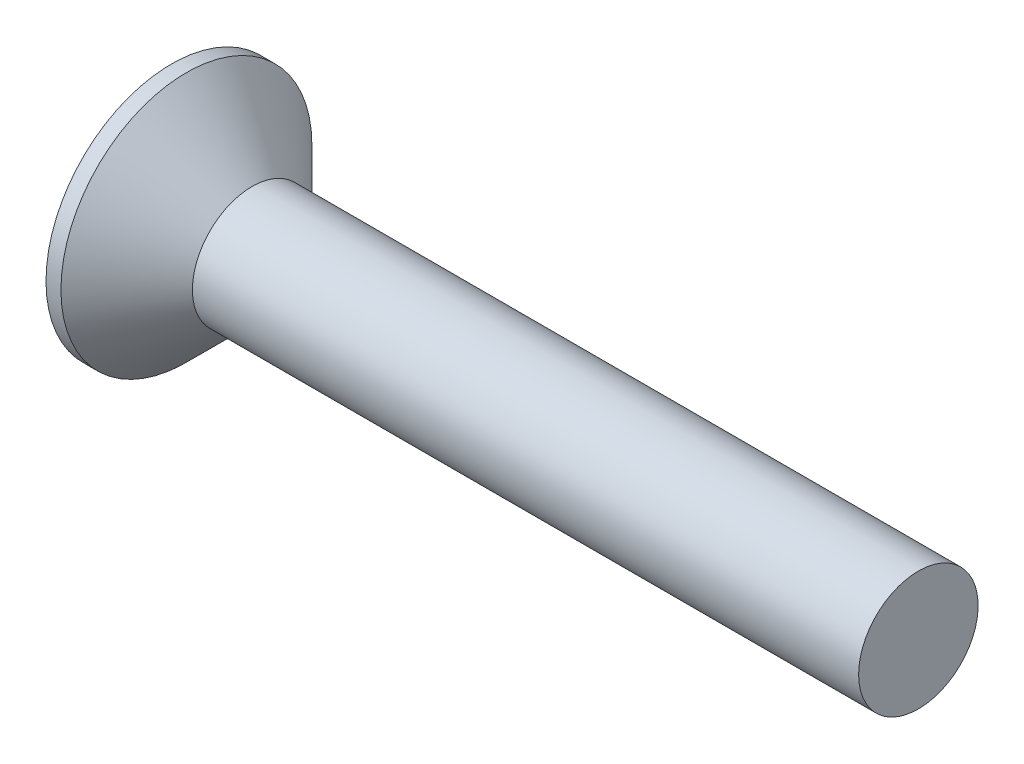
ISO-10303-21;
HEADER;
FILE_DESCRIPTION(('STEP AP214'),'2;1');
FILE_NAME('part.step','',(''),(''),'','','');
FILE_SCHEMA(('AUTOMOTIVE_DESIGN { 1 0 10303 214 1 1 1 1 }'));
ENDSEC;
DATA;
#1=APPLICATION_CONTEXT('core data for automotive mechanical design processes');
#2=APPLICATION_PROTOCOL_DEFINITION('international standard','automotive_design',2000,#1);
#3=PRODUCT_CONTEXT('',#1,'mechanical');
#4=PRODUCT('Part','Part','',(#3));
#5=PRODUCT_RELATED_PRODUCT_CATEGORY('part','',(#4));
#6=PRODUCT_DEFINITION_FORMATION('','',#4);
#7=PRODUCT_DEFINITION_CONTEXT('part definition',#1,'design');
#8=PRODUCT_DEFINITION('design','',#6,#7);
#9=PRODUCT_DEFINITION_SHAPE('','',#8);
#10=(LENGTH_UNIT() NAMED_UNIT(*) SI_UNIT(.MILLI.,.METRE.));
#11=(NAMED_UNIT(*) PLANE_ANGLE_UNIT() SI_UNIT($,.RADIAN.));
#12=(NAMED_UNIT(*) SI_UNIT($,.STERADIAN.) SOLID_ANGLE_UNIT());
#13=UNCERTAINTY_MEASURE_WITH_UNIT(LENGTH_MEASURE(1.E-05),#10,'distance_accuracy_value','');
#14=(GEOMETRIC_REPRESENTATION_CONTEXT(3) GLOBAL_UNCERTAINTY_ASSIGNED_CONTEXT((#13)) GLOBAL_UNIT_ASSIGNED_CONTEXT((#10,
#11,#12)) REPRESENTATION_CONTEXT('',''));
#15=CARTESIAN_POINT('',(0.,0.,0.));
#16=DIRECTION('',(0.,0.,1.));
#17=DIRECTION('',(1.,0.,0.));
#18=AXIS2_PLACEMENT_3D('',#15,#16,#17);
#19=CARTESIAN_POINT('',(0.,0.,0.));
#20=DIRECTION('',(-1.,0.,0.));
#21=DIRECTION('',(0.,0.,1.));
#22=AXIS2_PLACEMENT_3D('',#19,#20,#21);
#23=PLANE('',#22);
#24=CARTESIAN_POINT('',(0.,0.,0.));
#25=DIRECTION('',(-1.,0.,0.));
#26=DIRECTION('',(0.,0.,1.));
#27=AXIS2_PLACEMENT_3D('',#24,#25,#26);
#28=CIRCLE('',#27,4.2);
#29=CARTESIAN_POINT('',(0.,0.,4.2));
#30=VERTEX_POINT('',#29);
#31=EDGE_CURVE('E35',#30,#30,#28,.T.);
#32=ORIENTED_EDGE('',*,*,#31,.T.);
#33=EDGE_LOOP('',(#32));
#34=FACE_BOUND('',#33,.T.);
#35=DIRECTION('',(0.,1.,0.));
#36=VECTOR('',#35,1.);
#37=CARTESIAN_POINT('',(0.,-2.23,-0.48));
#38=LINE('',#37,#36);
#39=CARTESIAN_POINT('',(0.,-2.23,-0.48));
#40=VERTEX_POINT('',#39);
#41=CARTESIAN_POINT('',(0.,-0.479999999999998,-0.48));
#42=VERTEX_POINT('',#41);
#43=EDGE_CURVE('E131',#40,#42,#38,.T.);
#44=ORIENTED_EDGE('',*,*,#43,.T.);
#45=DIRECTION('',(0.,0.,-1.));
#46=VECTOR('',#45,1.);
#47=CARTESIAN_POINT('',(0.,-0.480000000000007,2.23));
#48=LINE('',#47,#46);
#49=CARTESIAN_POINT('',(0.,-0.479999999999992,-2.23));
#50=VERTEX_POINT('',#49);
#51=EDGE_CURVE('E99',#42,#50,#48,.T.);
#52=ORIENTED_EDGE('',*,*,#51,.T.);
#53=DIRECTION('',(0.,1.,0.));
#54=VECTOR('',#53,1.);
#55=CARTESIAN_POINT('',(0.,-0.479999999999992,-2.23));
#56=LINE('',#55,#54);
#57=CARTESIAN_POINT('',(0.,0.480000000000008,-2.23));
#58=VERTEX_POINT('',#57);
#59=EDGE_CURVE('E109',#50,#58,#56,.T.);
#60=ORIENTED_EDGE('',*,*,#59,.T.);
#61=DIRECTION('',(0.,0.,1.));
#62=VECTOR('',#61,1.);
#63=CARTESIAN_POINT('',(0.,0.480000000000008,-2.23));
#64=LINE('',#63,#62);
#65=CARTESIAN_POINT('',(0.,0.480000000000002,-0.48));
#66=VERTEX_POINT('',#65);
#67=EDGE_CURVE('E300',#58,#66,#64,.T.);
#68=ORIENTED_EDGE('',*,*,#67,.T.);
#69=CARTESIAN_POINT('',(0.,2.23,-0.48));
#70=VERTEX_POINT('',#69);
#71=EDGE_CURVE('E134',#66,#70,#38,.T.);
#72=ORIENTED_EDGE('',*,*,#71,.T.);
#73=DIRECTION('',(0.,0.,1.));
#74=VECTOR('',#73,1.);
#75=CARTESIAN_POINT('',(0.,2.23,-0.48));
#76=LINE('',#75,#74);
#77=CARTESIAN_POINT('',(0.,2.23,0.48));
#78=VERTEX_POINT('',#77);
#79=EDGE_CURVE('E138',#70,#78,#76,.T.);
#80=ORIENTED_EDGE('',*,*,#79,.T.);
#81=DIRECTION('',(0.,-1.,0.));
#82=VECTOR('',#81,1.);
#83=CARTESIAN_POINT('',(0.,2.23,0.48));
#84=LINE('',#83,#82);
#85=CARTESIAN_POINT('',(0.,0.479999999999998,0.48));
#86=VERTEX_POINT('',#85);
#87=EDGE_CURVE('E142',#78,#86,#84,.T.);
#88=ORIENTED_EDGE('',*,*,#87,.T.);
#89=CARTESIAN_POINT('',(0.,0.479999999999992,2.23));
#90=VERTEX_POINT('',#89);
#91=EDGE_CURVE('E110',#86,#90,#64,.T.);
#92=ORIENTED_EDGE('',*,*,#91,.T.);
#93=DIRECTION('',(0.,-1.,0.));
#94=VECTOR('',#93,1.);
#95=CARTESIAN_POINT('',(0.,0.479999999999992,2.23));
#96=LINE('',#95,#94);
#97=CARTESIAN_POINT('',(0.,-0.480000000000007,2.23));
#98=VERTEX_POINT('',#97);
#99=EDGE_CURVE('E292',#90,#98,#96,.T.);
#100=ORIENTED_EDGE('',*,*,#99,.T.);
#101=CARTESIAN_POINT('',(0.,-0.480000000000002,0.48));
#102=VERTEX_POINT('',#101);
#103=EDGE_CURVE('E299',#98,#102,#48,.T.);
#104=ORIENTED_EDGE('',*,*,#103,.T.);
#105=CARTESIAN_POINT('',(0.,-2.23,0.48));
#106=VERTEX_POINT('',#105);
#107=EDGE_CURVE('E141',#102,#106,#84,.T.);
#108=ORIENTED_EDGE('',*,*,#107,.T.);
#109=DIRECTION('',(0.,0.,-1.));
#110=VECTOR('',#109,1.);
#111=CARTESIAN_POINT('',(0.,-2.23,0.48));
#112=LINE('',#111,#110);
#113=EDGE_CURVE('E145',#106,#40,#112,.T.);
#114=ORIENTED_EDGE('',*,*,#113,.T.);
#115=EDGE_LOOP('',(#44,#52,#60,#68,#72,#80,#88,#92,#100,#104,#108,#114));
#116=FACE_BOUND('',#115,.T.);
#117=ADVANCED_FACE('F28',(#34,#116),#23,.T.);
#118=CARTESIAN_POINT('',(2.96959798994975,0.,0.21105527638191));
#119=DIRECTION('',(-0.0901968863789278,0.,-0.995923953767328));
#120=DIRECTION('',(-0.995923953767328,0.,0.0901968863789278));
#121=AXIS2_PLACEMENT_3D('',#118,#119,#120);
#122=PLANE('',#121);
#123=ORIENTED_EDGE('',*,*,#107,.F.);
#124=DIRECTION('',(0.991897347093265,0.0898322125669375,-0.0898322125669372));
#125=VECTOR('',#124,1.);
#126=CARTESIAN_POINT('',(2.98840392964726,-0.209352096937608,0.209352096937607));
#127=LINE('',#126,#125);
#128=CARTESIAN_POINT('',(2.65,-0.240000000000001,0.239999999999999));
#129=VERTEX_POINT('',#128);
#130=EDGE_CURVE('E128',#102,#129,#127,.T.);
#131=ORIENTED_EDGE('',*,*,#130,.T.);
#132=DIRECTION('',(0.797549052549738,0.59891419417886,-0.0722308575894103));
#133=VECTOR('',#132,1.);
#134=CARTESIAN_POINT('',(0.,-2.23,0.48));
#135=LINE('',#134,#133);
#136=EDGE_CURVE('E118',#106,#129,#135,.T.);
#137=ORIENTED_EDGE('',*,*,#136,.F.);
#138=EDGE_LOOP('',(#123,#131,#137));
#139=FACE_BOUND('',#138,.T.);
#140=ADVANCED_FACE('F176',(#139),#122,.T.);
#141=DIRECTION('',(0.797549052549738,-0.59891419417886,-0.0722308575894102));
#142=VECTOR('',#141,1.);
#143=CARTESIAN_POINT('',(0.,2.23,0.48));
#144=LINE('',#143,#142);
#145=CARTESIAN_POINT('',(2.65,0.24,0.24));
#146=VERTEX_POINT('',#145);
#147=EDGE_CURVE('E42',#78,#146,#144,.T.);
#148=ORIENTED_EDGE('',*,*,#147,.T.);
#149=DIRECTION('',(-0.991897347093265,0.0898322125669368,0.0898322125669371));
#150=VECTOR('',#149,1.);
#151=CARTESIAN_POINT('',(2.98840392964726,0.209352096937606,0.209352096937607));
#152=LINE('',#151,#150);
#153=EDGE_CURVE('E310',#146,#86,#152,.T.);
#154=ORIENTED_EDGE('',*,*,#153,.T.);
#155=ORIENTED_EDGE('',*,*,#87,.F.);
#156=EDGE_LOOP('',(#148,#154,#155));
#157=FACE_BOUND('',#156,.T.);
#158=ADVANCED_FACE('F181',(#157),#122,.T.);
#159=CARTESIAN_POINT('',(2.96959798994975,0.,-0.21105527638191));
#160=DIRECTION('',(-0.0901968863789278,0.,0.995923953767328));
#161=DIRECTION('',(0.995923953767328,0.,0.0901968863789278));
#162=AXIS2_PLACEMENT_3D('',#159,#160,#161);
#163=PLANE('',#162);
#164=DIRECTION('',(0.797549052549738,0.59891419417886,0.0722308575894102));
#165=VECTOR('',#164,1.);
#166=CARTESIAN_POINT('',(0.,-2.23,-0.48));
#167=LINE('',#166,#165);
#168=CARTESIAN_POINT('',(2.65,-0.239999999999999,-0.240000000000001));
#169=VERTEX_POINT('',#168);
#170=EDGE_CURVE('E50',#40,#169,#167,.T.);
#171=ORIENTED_EDGE('',*,*,#170,.T.);
#172=DIRECTION('',(-0.991897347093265,-0.0898322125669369,-0.0898322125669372));
#173=VECTOR('',#172,1.);
#174=CARTESIAN_POINT('',(2.98840392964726,-0.209352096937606,-0.209352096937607));
#175=LINE('',#174,#173);
#176=EDGE_CURVE('E11',#169,#42,#175,.T.);
#177=ORIENTED_EDGE('',*,*,#176,.T.);
#178=ORIENTED_EDGE('',*,*,#43,.F.);
#179=EDGE_LOOP('',(#171,#177,#178));
#180=FACE_BOUND('',#179,.T.);
#181=ADVANCED_FACE('F130',(#180),#163,.T.);
#182=ORIENTED_EDGE('',*,*,#71,.F.);
#183=DIRECTION('',(0.991897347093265,-0.0898322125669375,0.0898322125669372));
#184=VECTOR('',#183,1.);
#185=CARTESIAN_POINT('',(2.98840392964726,0.209352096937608,-0.209352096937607));
#186=LINE('',#185,#184);
#187=CARTESIAN_POINT('',(2.65,0.24,-0.24));
#188=VERTEX_POINT('',#187);
#189=EDGE_CURVE('E307',#66,#188,#186,.T.);
#190=ORIENTED_EDGE('',*,*,#189,.T.);
#191=DIRECTION('',(0.797549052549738,-0.59891419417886,0.0722308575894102));
#192=VECTOR('',#191,1.);
#193=CARTESIAN_POINT('',(0.,2.23,-0.48));
#194=LINE('',#193,#192);
#195=EDGE_CURVE('E121',#70,#188,#194,.T.);
#196=ORIENTED_EDGE('',*,*,#195,.F.);
#197=EDGE_LOOP('',(#182,#190,#196));
#198=FACE_BOUND('',#197,.T.);
#199=ADVANCED_FACE('F164',(#198),#163,.T.);
#200=CARTESIAN_POINT('',(-6.34999999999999,0.,0.));
#201=DIRECTION('',(-1.,0.,0.));
#202=DIRECTION('',(0.,0.,1.));
#203=AXIS2_PLACEMENT_3D('',#200,#201,#202);
#204=CYLINDRICAL_SURFACE('',#203,4.2);
#205=CARTESIAN_POINT('',(0.500000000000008,0.,0.));
#206=DIRECTION('',(-1.,0.,0.));
#207=DIRECTION('',(0.,0.,1.));
#208=AXIS2_PLACEMENT_3D('',#205,#206,#207);
#209=CIRCLE('',#208,4.2);
#210=CARTESIAN_POINT('',(0.500000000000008,0.,4.2));
#211=VERTEX_POINT('',#210);
#212=EDGE_CURVE('E154',#211,#211,#209,.T.);
#213=ORIENTED_EDGE('',*,*,#212,.T.);
#214=EDGE_LOOP('',(#213));
#215=FACE_BOUND('',#214,.T.);
#216=ORIENTED_EDGE('',*,*,#31,.F.);
#217=EDGE_LOOP('',(#216));
#218=FACE_BOUND('',#217,.T.);
#219=ADVANCED_FACE('F161',(#215,#218),#204,.T.);
#220=CARTESIAN_POINT('',(0.500000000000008,0.,0.));
#221=DIRECTION('',(-1.,0.,0.));
#222=DIRECTION('',(0.,0.,1.));
#223=AXIS2_PLACEMENT_3D('',#220,#221,#222);
#224=CONICAL_SURFACE('',#223,4.2,0.78539816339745);
#225=CARTESIAN_POINT('',(2.7,0.,0.));
#226=DIRECTION('',(-1.,0.,0.));
#227=DIRECTION('',(0.,0.,1.));
#228=AXIS2_PLACEMENT_3D('',#225,#226,#227);
#229=CIRCLE('',#228,2.);
#230=CARTESIAN_POINT('',(2.7,0.,2.));
#231=VERTEX_POINT('',#230);
#232=EDGE_CURVE('E151',#231,#231,#229,.T.);
#233=ORIENTED_EDGE('',*,*,#232,.T.);
#234=EDGE_LOOP('',(#233));
#235=FACE_BOUND('',#234,.T.);
#236=ORIENTED_EDGE('',*,*,#212,.F.);
#237=EDGE_LOOP('',(#236));
#238=FACE_BOUND('',#237,.T.);
#239=ADVANCED_FACE('F163',(#235,#238),#224,.T.);
#240=CARTESIAN_POINT('',(-6.34999999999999,0.,0.));
#241=DIRECTION('',(-1.,0.,0.));
#242=DIRECTION('',(0.,0.,1.));
#243=AXIS2_PLACEMENT_3D('',#240,#241,#242);
#244=CYLINDRICAL_SURFACE('',#243,2.);
#245=CARTESIAN_POINT('',(25.,0.,0.));
#246=DIRECTION('',(-1.,0.,0.));
#247=DIRECTION('',(0.,0.,1.));
#248=AXIS2_PLACEMENT_3D('',#245,#246,#247);
#249=CIRCLE('',#248,2.);
#250=CARTESIAN_POINT('',(25.,0.,2.));
#251=VERTEX_POINT('',#250);
#252=EDGE_CURVE('E147',#251,#251,#249,.T.);
#253=ORIENTED_EDGE('',*,*,#252,.T.);
#254=EDGE_LOOP('',(#253));
#255=FACE_BOUND('',#254,.T.);
#256=ORIENTED_EDGE('',*,*,#232,.F.);
#257=EDGE_LOOP('',(#256));
#258=FACE_BOUND('',#257,.T.);
#259=ADVANCED_FACE('F169',(#255,#258),#244,.T.);
#260=CARTESIAN_POINT('',(25.,2.,0.));
#261=DIRECTION('',(1.,0.,0.));
#262=DIRECTION('',(0.,0.,-1.));
#263=AXIS2_PLACEMENT_3D('',#260,#261,#262);
#264=PLANE('',#263);
#265=ORIENTED_EDGE('',*,*,#252,.F.);
#266=EDGE_LOOP('',(#265));
#267=FACE_BOUND('',#266,.T.);
#268=ADVANCED_FACE('F194',(#267),#264,.T.);
#269=CARTESIAN_POINT('',(2.65,0.24,-0.24));
#270=DIRECTION('',(1.,0.,0.));
#271=DIRECTION('',(0.,0.,-1.));
#272=AXIS2_PLACEMENT_3D('',#269,#270,#271);
#273=PLANE('',#272);
#274=DIRECTION('',(0.,1.,0.));
#275=VECTOR('',#274,1.);
#276=CARTESIAN_POINT('',(2.65,-0.24,-0.24));
#277=LINE('',#276,#275);
#278=EDGE_CURVE('E106',#169,#188,#277,.T.);
#279=ORIENTED_EDGE('',*,*,#278,.F.);
#280=DIRECTION('',(0.,0.,-1.));
#281=VECTOR('',#280,1.);
#282=CARTESIAN_POINT('',(2.65,-0.24,0.24));
#283=LINE('',#282,#281);
#284=EDGE_CURVE('E115',#129,#169,#283,.T.);
#285=ORIENTED_EDGE('',*,*,#284,.F.);
#286=DIRECTION('',(0.,-1.,0.));
#287=VECTOR('',#286,1.);
#288=CARTESIAN_POINT('',(2.65,0.24,0.24));
#289=LINE('',#288,#287);
#290=EDGE_CURVE('E122',#146,#129,#289,.T.);
#291=ORIENTED_EDGE('',*,*,#290,.F.);
#292=DIRECTION('',(0.,0.,1.));
#293=VECTOR('',#292,1.);
#294=CARTESIAN_POINT('',(2.65,0.24,-0.24));
#295=LINE('',#294,#293);
#296=EDGE_CURVE('E126',#188,#146,#295,.T.);
#297=ORIENTED_EDGE('',*,*,#296,.F.);
#298=EDGE_LOOP('',(#279,#285,#291,#297));
#299=FACE_BOUND('',#298,.T.);
#300=ADVANCED_FACE('F125',(#299),#273,.F.);
#301=CARTESIAN_POINT('',(0.,-2.23,-0.48));
#302=DIRECTION('',(-0.600482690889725,0.799637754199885,0.));
#303=DIRECTION('',(-0.799637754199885,-0.600482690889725,0.));
#304=AXIS2_PLACEMENT_3D('',#301,#302,#303);
#305=PLANE('',#304);
#306=ORIENTED_EDGE('',*,*,#170,.F.);
#307=ORIENTED_EDGE('',*,*,#113,.F.);
#308=ORIENTED_EDGE('',*,*,#136,.T.);
#309=ORIENTED_EDGE('',*,*,#284,.T.);
#310=EDGE_LOOP('',(#306,#307,#308,#309));
#311=FACE_BOUND('',#310,.T.);
#312=ADVANCED_FACE('F116',(#311),#305,.T.);
#313=CARTESIAN_POINT('',(2.65,0.24,0.24));
#314=DIRECTION('',(-0.600482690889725,-0.799637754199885,0.));
#315=DIRECTION('',(0.799637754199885,-0.600482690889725,0.));
#316=AXIS2_PLACEMENT_3D('',#313,#314,#315);
#317=PLANE('',#316);
#318=ORIENTED_EDGE('',*,*,#147,.F.);
#319=ORIENTED_EDGE('',*,*,#79,.F.);
#320=ORIENTED_EDGE('',*,*,#195,.T.);
#321=ORIENTED_EDGE('',*,*,#296,.T.);
#322=EDGE_LOOP('',(#318,#319,#320,#321));
#323=FACE_BOUND('',#322,.T.);
#324=ADVANCED_FACE('F193',(#323),#317,.T.);
#325=CARTESIAN_POINT('',(2.96959798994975,-0.21105527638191,0.));
#326=DIRECTION('',(-0.0901968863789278,0.995923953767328,0.));
#327=DIRECTION('',(-0.995923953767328,-0.0901968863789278,0.));
#328=AXIS2_PLACEMENT_3D('',#325,#326,#327);
#329=PLANE('',#328);
#330=DIRECTION('',(0.797549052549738,0.0722308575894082,0.59891419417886));
#331=VECTOR('',#330,1.);
#332=CARTESIAN_POINT('',(0.,-0.479999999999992,-2.23));
#333=LINE('',#332,#331);
#334=EDGE_CURVE('E97',#50,#169,#333,.T.);
#335=ORIENTED_EDGE('',*,*,#334,.F.);
#336=ORIENTED_EDGE('',*,*,#51,.F.);
#337=ORIENTED_EDGE('',*,*,#176,.F.);
#338=EDGE_LOOP('',(#335,#336,#337));
#339=FACE_BOUND('',#338,.T.);
#340=ADVANCED_FACE('F96',(#339),#329,.T.);
#341=CARTESIAN_POINT('',(2.96959798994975,0.21105527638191,0.));
#342=DIRECTION('',(-0.0901968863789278,-0.995923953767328,0.));
#343=DIRECTION('',(0.995923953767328,-0.0901968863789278,0.));
#344=AXIS2_PLACEMENT_3D('',#341,#342,#343);
#345=PLANE('',#344);
#346=ORIENTED_EDGE('',*,*,#67,.F.);
#347=DIRECTION('',(0.797549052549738,-0.0722308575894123,0.59891419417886));
#348=VECTOR('',#347,1.);
#349=CARTESIAN_POINT('',(0.,0.480000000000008,-2.23));
#350=LINE('',#349,#348);
#351=EDGE_CURVE('E111',#58,#188,#350,.T.);
#352=ORIENTED_EDGE('',*,*,#351,.T.);
#353=ORIENTED_EDGE('',*,*,#189,.F.);
#354=EDGE_LOOP('',(#346,#352,#353));
#355=FACE_BOUND('',#354,.T.);
#356=ADVANCED_FACE('F251',(#355),#345,.T.);
#357=CARTESIAN_POINT('',(0.,0.480000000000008,-2.23));
#358=DIRECTION('',(-0.600482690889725,0.,0.799637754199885));
#359=DIRECTION('',(-0.799637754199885,0.,-0.600482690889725));
#360=AXIS2_PLACEMENT_3D('',#357,#358,#359);
#361=PLANE('',#360);
#362=ORIENTED_EDGE('',*,*,#351,.F.);
#363=ORIENTED_EDGE('',*,*,#59,.F.);
#364=ORIENTED_EDGE('',*,*,#334,.T.);
#365=ORIENTED_EDGE('',*,*,#278,.T.);
#366=EDGE_LOOP('',(#362,#363,#364,#365));
#367=FACE_BOUND('',#366,.T.);
#368=ADVANCED_FACE('F104',(#367),#361,.T.);
#369=ORIENTED_EDGE('',*,*,#103,.F.);
#370=DIRECTION('',(0.797549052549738,0.0722308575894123,-0.59891419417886));
#371=VECTOR('',#370,1.);
#372=CARTESIAN_POINT('',(0.,-0.480000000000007,2.23));
#373=LINE('',#372,#371);
#374=EDGE_CURVE('E290',#98,#129,#373,.T.);
#375=ORIENTED_EDGE('',*,*,#374,.T.);
#376=ORIENTED_EDGE('',*,*,#130,.F.);
#377=EDGE_LOOP('',(#369,#375,#376));
#378=FACE_BOUND('',#377,.T.);
#379=ADVANCED_FACE('F253',(#378),#329,.T.);
#380=DIRECTION('',(0.797549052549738,-0.0722308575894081,-0.59891419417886));
#381=VECTOR('',#380,1.);
#382=CARTESIAN_POINT('',(0.,0.479999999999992,2.23));
#383=LINE('',#382,#381);
#384=EDGE_CURVE('E295',#90,#146,#383,.T.);
#385=ORIENTED_EDGE('',*,*,#384,.F.);
#386=ORIENTED_EDGE('',*,*,#91,.F.);
#387=ORIENTED_EDGE('',*,*,#153,.F.);
#388=EDGE_LOOP('',(#385,#386,#387));
#389=FACE_BOUND('',#388,.T.);
#390=ADVANCED_FACE('F261',(#389),#345,.T.);
#391=CARTESIAN_POINT('',(2.65,-0.240000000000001,0.239999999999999));
#392=DIRECTION('',(-0.600482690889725,0.,-0.799637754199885));
#393=DIRECTION('',(0.799637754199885,0.,-0.600482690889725));
#394=AXIS2_PLACEMENT_3D('',#391,#392,#393);
#395=PLANE('',#394);
#396=ORIENTED_EDGE('',*,*,#374,.F.);
#397=ORIENTED_EDGE('',*,*,#99,.F.);
#398=ORIENTED_EDGE('',*,*,#384,.T.);
#399=ORIENTED_EDGE('',*,*,#290,.T.);
#400=EDGE_LOOP('',(#396,#397,#398,#399));
#401=FACE_BOUND('',#400,.T.);
#402=ADVANCED_FACE('F279',(#401),#395,.T.);
#403=CLOSED_SHELL('',(#117,#140,#158,#181,#199,#219,#239,#259,#268,#300,#312,#324,#340,#356,
#368,#379,#390,#402));
#404=MANIFOLD_SOLID_BREP('B2',#403);
#405=ADVANCED_BREP_SHAPE_REPRESENTATION('',(#18,#404),#14);
#406=SHAPE_DEFINITION_REPRESENTATION(#9,#405);
ENDSEC;
END-ISO-10303-21;
